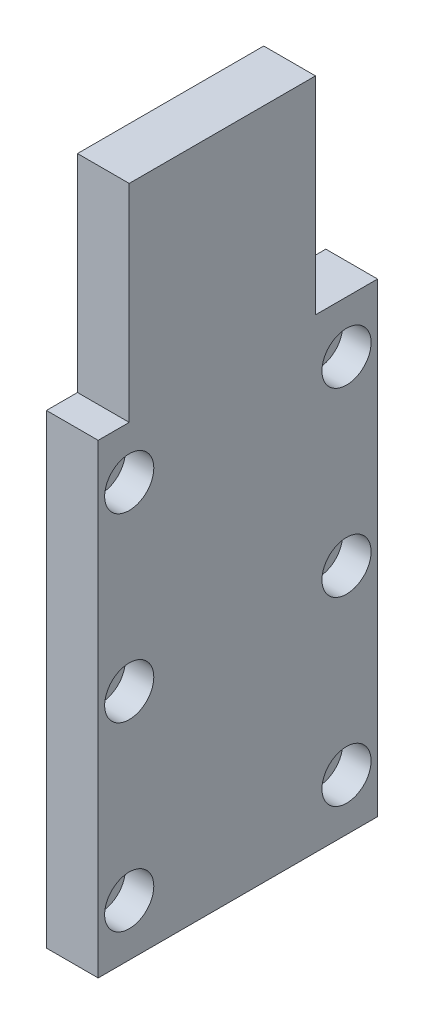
ISO-10303-21;
HEADER;
FILE_DESCRIPTION(('STEP AP214'),'2;1');
FILE_NAME('part.step','',(''),(''),'','','');
FILE_SCHEMA(('AUTOMOTIVE_DESIGN { 1 0 10303 214 1 1 1 1 }'));
ENDSEC;
DATA;
#1=APPLICATION_CONTEXT('core data for automotive mechanical design processes');
#2=APPLICATION_PROTOCOL_DEFINITION('international standard','automotive_design',2000,#1);
#3=PRODUCT_CONTEXT('',#1,'mechanical');
#4=PRODUCT('Part','Part','',(#3));
#5=PRODUCT_RELATED_PRODUCT_CATEGORY('part','',(#4));
#6=PRODUCT_DEFINITION_FORMATION('','',#4);
#7=PRODUCT_DEFINITION_CONTEXT('part definition',#1,'design');
#8=PRODUCT_DEFINITION('design','',#6,#7);
#9=PRODUCT_DEFINITION_SHAPE('','',#8);
#10=(LENGTH_UNIT() NAMED_UNIT(*) SI_UNIT(.MILLI.,.METRE.));
#11=(NAMED_UNIT(*) PLANE_ANGLE_UNIT() SI_UNIT($,.RADIAN.));
#12=(NAMED_UNIT(*) SI_UNIT($,.STERADIAN.) SOLID_ANGLE_UNIT());
#13=UNCERTAINTY_MEASURE_WITH_UNIT(LENGTH_MEASURE(1.E-05),#10,'distance_accuracy_value','');
#14=(GEOMETRIC_REPRESENTATION_CONTEXT(3) GLOBAL_UNCERTAINTY_ASSIGNED_CONTEXT((#13)) GLOBAL_UNIT_ASSIGNED_CONTEXT((#10,
#11,#12)) REPRESENTATION_CONTEXT('',''));
#15=CARTESIAN_POINT('',(0.,0.,0.));
#16=DIRECTION('',(0.,0.,1.));
#17=DIRECTION('',(1.,0.,0.));
#18=AXIS2_PLACEMENT_3D('',#15,#16,#17);
#19=CARTESIAN_POINT('',(-44.,9.99999999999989,48.));
#20=DIRECTION('',(1.,0.,0.));
#21=DIRECTION('',(0.,0.,-1.));
#22=AXIS2_PLACEMENT_3D('',#19,#20,#21);
#23=CYLINDRICAL_SURFACE('',#22,2.75);
#24=CARTESIAN_POINT('',(0.,9.99999999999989,48.));
#25=DIRECTION('',(1.,0.,0.));
#26=DIRECTION('',(0.,0.,-1.));
#27=AXIS2_PLACEMENT_3D('',#24,#25,#26);
#28=CIRCLE('',#27,2.75);
#29=CARTESIAN_POINT('',(0.,9.99999999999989,45.25));
#30=VERTEX_POINT('',#29);
#31=EDGE_CURVE('E161',#30,#30,#28,.T.);
#32=ORIENTED_EDGE('',*,*,#31,.F.);
#33=EDGE_LOOP('',(#32));
#34=FACE_BOUND('',#33,.T.);
#35=CARTESIAN_POINT('',(4.5,9.99999999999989,48.));
#36=DIRECTION('',(1.,0.,0.));
#37=DIRECTION('',(0.,0.,-1.));
#38=AXIS2_PLACEMENT_3D('',#35,#36,#37);
#39=CIRCLE('',#38,2.75);
#40=CARTESIAN_POINT('',(4.5,9.99999999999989,45.25));
#41=VERTEX_POINT('',#40);
#42=EDGE_CURVE('E37',#41,#41,#39,.F.);
#43=ORIENTED_EDGE('',*,*,#42,.F.);
#44=EDGE_LOOP('',(#43));
#45=FACE_BOUND('',#44,.T.);
#46=ADVANCED_FACE('F33',(#34,#45),#23,.F.);
#47=CARTESIAN_POINT('',(-44.,9.99999999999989,6.));
#48=DIRECTION('',(1.,0.,0.));
#49=DIRECTION('',(0.,0.,-1.));
#50=AXIS2_PLACEMENT_3D('',#47,#48,#49);
#51=CYLINDRICAL_SURFACE('',#50,2.75);
#52=CARTESIAN_POINT('',(0.,9.99999999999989,6.));
#53=DIRECTION('',(1.,0.,0.));
#54=DIRECTION('',(0.,0.,-1.));
#55=AXIS2_PLACEMENT_3D('',#52,#53,#54);
#56=CIRCLE('',#55,2.75);
#57=CARTESIAN_POINT('',(0.,9.99999999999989,3.25));
#58=VERTEX_POINT('',#57);
#59=EDGE_CURVE('E158',#58,#58,#56,.T.);
#60=ORIENTED_EDGE('',*,*,#59,.F.);
#61=EDGE_LOOP('',(#60));
#62=FACE_BOUND('',#61,.T.);
#63=CARTESIAN_POINT('',(4.5,9.99999999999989,6.));
#64=DIRECTION('',(1.,0.,0.));
#65=DIRECTION('',(0.,0.,-1.));
#66=AXIS2_PLACEMENT_3D('',#63,#64,#65);
#67=CIRCLE('',#66,2.75);
#68=CARTESIAN_POINT('',(4.5,9.99999999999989,3.25));
#69=VERTEX_POINT('',#68);
#70=EDGE_CURVE('E184',#69,#69,#67,.F.);
#71=ORIENTED_EDGE('',*,*,#70,.F.);
#72=EDGE_LOOP('',(#71));
#73=FACE_BOUND('',#72,.T.);
#74=ADVANCED_FACE('F259',(#62,#73),#51,.F.);
#75=CARTESIAN_POINT('',(-44.,44.9999999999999,6.));
#76=DIRECTION('',(1.,0.,0.));
#77=DIRECTION('',(0.,0.,-1.));
#78=AXIS2_PLACEMENT_3D('',#75,#76,#77);
#79=CYLINDRICAL_SURFACE('',#78,2.75);
#80=CARTESIAN_POINT('',(0.,44.9999999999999,6.));
#81=DIRECTION('',(1.,0.,0.));
#82=DIRECTION('',(0.,0.,-1.));
#83=AXIS2_PLACEMENT_3D('',#80,#81,#82);
#84=CIRCLE('',#83,2.75);
#85=CARTESIAN_POINT('',(0.,44.9999999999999,3.25));
#86=VERTEX_POINT('',#85);
#87=EDGE_CURVE('E155',#86,#86,#84,.T.);
#88=ORIENTED_EDGE('',*,*,#87,.F.);
#89=EDGE_LOOP('',(#88));
#90=FACE_BOUND('',#89,.T.);
#91=CARTESIAN_POINT('',(4.5,44.9999999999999,6.));
#92=DIRECTION('',(1.,0.,0.));
#93=DIRECTION('',(0.,0.,-1.));
#94=AXIS2_PLACEMENT_3D('',#91,#92,#93);
#95=CIRCLE('',#94,2.75);
#96=CARTESIAN_POINT('',(4.5,44.9999999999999,3.25));
#97=VERTEX_POINT('',#96);
#98=EDGE_CURVE('E180',#97,#97,#95,.F.);
#99=ORIENTED_EDGE('',*,*,#98,.F.);
#100=EDGE_LOOP('',(#99));
#101=FACE_BOUND('',#100,.T.);
#102=ADVANCED_FACE('F265',(#90,#101),#79,.F.);
#103=CARTESIAN_POINT('',(-44.,44.9999999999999,48.));
#104=DIRECTION('',(1.,0.,0.));
#105=DIRECTION('',(0.,0.,-1.));
#106=AXIS2_PLACEMENT_3D('',#103,#104,#105);
#107=CYLINDRICAL_SURFACE('',#106,2.75);
#108=CARTESIAN_POINT('',(0.,44.9999999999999,48.));
#109=DIRECTION('',(1.,0.,0.));
#110=DIRECTION('',(0.,0.,-1.));
#111=AXIS2_PLACEMENT_3D('',#108,#109,#110);
#112=CIRCLE('',#111,2.75);
#113=CARTESIAN_POINT('',(0.,44.9999999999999,45.25));
#114=VERTEX_POINT('',#113);
#115=EDGE_CURVE('E152',#114,#114,#112,.T.);
#116=ORIENTED_EDGE('',*,*,#115,.F.);
#117=EDGE_LOOP('',(#116));
#118=FACE_BOUND('',#117,.T.);
#119=CARTESIAN_POINT('',(4.5,44.9999999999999,48.));
#120=DIRECTION('',(1.,0.,0.));
#121=DIRECTION('',(0.,0.,-1.));
#122=AXIS2_PLACEMENT_3D('',#119,#120,#121);
#123=CIRCLE('',#122,2.75);
#124=CARTESIAN_POINT('',(4.5,44.9999999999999,45.25));
#125=VERTEX_POINT('',#124);
#126=EDGE_CURVE('E175',#125,#125,#123,.F.);
#127=ORIENTED_EDGE('',*,*,#126,.F.);
#128=EDGE_LOOP('',(#127));
#129=FACE_BOUND('',#128,.T.);
#130=ADVANCED_FACE('F276',(#118,#129),#107,.F.);
#131=CARTESIAN_POINT('',(-44.,79.9999999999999,6.));
#132=DIRECTION('',(1.,0.,0.));
#133=DIRECTION('',(0.,0.,-1.));
#134=AXIS2_PLACEMENT_3D('',#131,#132,#133);
#135=CYLINDRICAL_SURFACE('',#134,2.75);
#136=CARTESIAN_POINT('',(0.,79.9999999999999,6.));
#137=DIRECTION('',(1.,0.,0.));
#138=DIRECTION('',(0.,0.,-1.));
#139=AXIS2_PLACEMENT_3D('',#136,#137,#138);
#140=CIRCLE('',#139,2.75);
#141=CARTESIAN_POINT('',(0.,79.9999999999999,3.25));
#142=VERTEX_POINT('',#141);
#143=EDGE_CURVE('E149',#142,#142,#140,.T.);
#144=ORIENTED_EDGE('',*,*,#143,.F.);
#145=EDGE_LOOP('',(#144));
#146=FACE_BOUND('',#145,.T.);
#147=CARTESIAN_POINT('',(4.5,79.9999999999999,6.));
#148=DIRECTION('',(1.,0.,0.));
#149=DIRECTION('',(0.,0.,-1.));
#150=AXIS2_PLACEMENT_3D('',#147,#148,#149);
#151=CIRCLE('',#150,2.75);
#152=CARTESIAN_POINT('',(4.5,79.9999999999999,3.25));
#153=VERTEX_POINT('',#152);
#154=EDGE_CURVE('E170',#153,#153,#151,.F.);
#155=ORIENTED_EDGE('',*,*,#154,.F.);
#156=EDGE_LOOP('',(#155));
#157=FACE_BOUND('',#156,.T.);
#158=ADVANCED_FACE('F280',(#146,#157),#135,.F.);
#159=CARTESIAN_POINT('',(-44.,79.9999999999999,48.));
#160=DIRECTION('',(1.,0.,0.));
#161=DIRECTION('',(0.,0.,-1.));
#162=AXIS2_PLACEMENT_3D('',#159,#160,#161);
#163=CYLINDRICAL_SURFACE('',#162,2.75);
#164=CARTESIAN_POINT('',(0.,79.9999999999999,48.));
#165=DIRECTION('',(1.,0.,0.));
#166=DIRECTION('',(0.,0.,-1.));
#167=AXIS2_PLACEMENT_3D('',#164,#165,#166);
#168=CIRCLE('',#167,2.75);
#169=CARTESIAN_POINT('',(0.,79.9999999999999,45.25));
#170=VERTEX_POINT('',#169);
#171=EDGE_CURVE('E133',#170,#170,#168,.T.);
#172=ORIENTED_EDGE('',*,*,#171,.F.);
#173=EDGE_LOOP('',(#172));
#174=FACE_BOUND('',#173,.T.);
#175=CARTESIAN_POINT('',(4.5,79.9999999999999,48.));
#176=DIRECTION('',(1.,0.,0.));
#177=DIRECTION('',(0.,0.,-1.));
#178=AXIS2_PLACEMENT_3D('',#175,#176,#177);
#179=CIRCLE('',#178,2.75);
#180=CARTESIAN_POINT('',(4.5,79.9999999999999,45.25));
#181=VERTEX_POINT('',#180);
#182=EDGE_CURVE('E166',#181,#181,#179,.F.);
#183=ORIENTED_EDGE('',*,*,#182,.F.);
#184=EDGE_LOOP('',(#183));
#185=FACE_BOUND('',#184,.T.);
#186=ADVANCED_FACE('F284',(#174,#185),#163,.F.);
#187=CARTESIAN_POINT('',(10.,0.,54.));
#188=DIRECTION('',(-1.,0.,0.));
#189=DIRECTION('',(0.,0.,1.));
#190=AXIS2_PLACEMENT_3D('',#187,#188,#189);
#191=PLANE('',#190);
#192=CARTESIAN_POINT('',(10.,9.99999999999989,48.));
#193=DIRECTION('',(1.,0.,0.));
#194=DIRECTION('',(0.,0.,-1.));
#195=AXIS2_PLACEMENT_3D('',#192,#193,#194);
#196=CIRCLE('',#195,4.75);
#197=CARTESIAN_POINT('',(10.,9.99999999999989,43.25));
#198=VERTEX_POINT('',#197);
#199=EDGE_CURVE('E200',#198,#198,#196,.T.);
#200=ORIENTED_EDGE('',*,*,#199,.F.);
#201=EDGE_LOOP('',(#200));
#202=FACE_BOUND('',#201,.T.);
#203=CARTESIAN_POINT('',(10.,9.99999999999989,6.));
#204=DIRECTION('',(1.,0.,0.));
#205=DIRECTION('',(0.,0.,-1.));
#206=AXIS2_PLACEMENT_3D('',#203,#204,#205);
#207=CIRCLE('',#206,4.75);
#208=CARTESIAN_POINT('',(10.,9.99999999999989,1.25));
#209=VERTEX_POINT('',#208);
#210=EDGE_CURVE('E193',#209,#209,#207,.T.);
#211=ORIENTED_EDGE('',*,*,#210,.F.);
#212=EDGE_LOOP('',(#211));
#213=FACE_BOUND('',#212,.T.);
#214=CARTESIAN_POINT('',(10.,44.9999999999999,6.));
#215=DIRECTION('',(1.,0.,0.));
#216=DIRECTION('',(0.,0.,-1.));
#217=AXIS2_PLACEMENT_3D('',#214,#215,#216);
#218=CIRCLE('',#217,4.75);
#219=CARTESIAN_POINT('',(10.,44.9999999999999,1.25));
#220=VERTEX_POINT('',#219);
#221=EDGE_CURVE('E186',#220,#220,#218,.T.);
#222=ORIENTED_EDGE('',*,*,#221,.F.);
#223=EDGE_LOOP('',(#222));
#224=FACE_BOUND('',#223,.T.);
#225=CARTESIAN_POINT('',(10.,44.9999999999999,48.));
#226=DIRECTION('',(1.,0.,0.));
#227=DIRECTION('',(0.,0.,-1.));
#228=AXIS2_PLACEMENT_3D('',#225,#226,#227);
#229=CIRCLE('',#228,4.75);
#230=CARTESIAN_POINT('',(10.,44.9999999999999,43.25));
#231=VERTEX_POINT('',#230);
#232=EDGE_CURVE('E182',#231,#231,#229,.T.);
#233=ORIENTED_EDGE('',*,*,#232,.F.);
#234=EDGE_LOOP('',(#233));
#235=FACE_BOUND('',#234,.T.);
#236=CARTESIAN_POINT('',(10.,79.9999999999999,6.));
#237=DIRECTION('',(1.,0.,0.));
#238=DIRECTION('',(0.,0.,-1.));
#239=AXIS2_PLACEMENT_3D('',#236,#237,#238);
#240=CIRCLE('',#239,4.75);
#241=CARTESIAN_POINT('',(10.,79.9999999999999,1.25));
#242=VERTEX_POINT('',#241);
#243=EDGE_CURVE('E178',#242,#242,#240,.T.);
#244=ORIENTED_EDGE('',*,*,#243,.F.);
#245=EDGE_LOOP('',(#244));
#246=FACE_BOUND('',#245,.T.);
#247=CARTESIAN_POINT('',(10.,79.9999999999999,48.));
#248=DIRECTION('',(1.,0.,0.));
#249=DIRECTION('',(0.,0.,-1.));
#250=AXIS2_PLACEMENT_3D('',#247,#248,#249);
#251=CIRCLE('',#250,4.75);
#252=CARTESIAN_POINT('',(10.,79.9999999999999,43.25));
#253=VERTEX_POINT('',#252);
#254=EDGE_CURVE('E173',#253,#253,#251,.T.);
#255=ORIENTED_EDGE('',*,*,#254,.F.);
#256=EDGE_LOOP('',(#255));
#257=FACE_BOUND('',#256,.T.);
#258=DIRECTION('',(0.,1.,0.));
#259=VECTOR('',#258,1.);
#260=CARTESIAN_POINT('',(10.,89.9999999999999,12.));
#261=LINE('',#260,#259);
#262=CARTESIAN_POINT('',(10.,89.9999999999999,12.));
#263=VERTEX_POINT('',#262);
#264=CARTESIAN_POINT('',(10.,130.,12.));
#265=VERTEX_POINT('',#264);
#266=EDGE_CURVE('E219',#263,#265,#261,.T.);
#267=ORIENTED_EDGE('',*,*,#266,.T.);
#268=DIRECTION('',(0.,0.,-1.));
#269=VECTOR('',#268,1.);
#270=CARTESIAN_POINT('',(10.,130.,54.));
#271=LINE('',#270,#269);
#272=CARTESIAN_POINT('',(10.,130.,48.));
#273=VERTEX_POINT('',#272);
#274=EDGE_CURVE('E142',#273,#265,#271,.T.);
#275=ORIENTED_EDGE('',*,*,#274,.F.);
#276=DIRECTION('',(0.,-1.,0.));
#277=VECTOR('',#276,1.);
#278=CARTESIAN_POINT('',(10.,89.9999999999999,48.));
#279=LINE('',#278,#277);
#280=CARTESIAN_POINT('',(10.,89.9999999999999,48.));
#281=VERTEX_POINT('',#280);
#282=EDGE_CURVE('E115',#273,#281,#279,.T.);
#283=ORIENTED_EDGE('',*,*,#282,.T.);
#284=DIRECTION('',(0.,0.,1.));
#285=VECTOR('',#284,1.);
#286=CARTESIAN_POINT('',(10.,89.9999999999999,54.));
#287=LINE('',#286,#285);
#288=CARTESIAN_POINT('',(10.,89.9999999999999,54.));
#289=VERTEX_POINT('',#288);
#290=EDGE_CURVE('E101',#281,#289,#287,.T.);
#291=ORIENTED_EDGE('',*,*,#290,.T.);
#292=DIRECTION('',(0.,1.,0.));
#293=VECTOR('',#292,1.);
#294=CARTESIAN_POINT('',(10.,0.,54.));
#295=LINE('',#294,#293);
#296=CARTESIAN_POINT('',(10.,0.,54.));
#297=VERTEX_POINT('',#296);
#298=EDGE_CURVE('E112',#297,#289,#295,.T.);
#299=ORIENTED_EDGE('',*,*,#298,.F.);
#300=DIRECTION('',(0.,0.,-1.));
#301=VECTOR('',#300,1.);
#302=CARTESIAN_POINT('',(10.,0.,54.));
#303=LINE('',#302,#301);
#304=CARTESIAN_POINT('',(10.,0.,0.));
#305=VERTEX_POINT('',#304);
#306=EDGE_CURVE('E145',#297,#305,#303,.T.);
#307=ORIENTED_EDGE('',*,*,#306,.T.);
#308=DIRECTION('',(0.,1.,0.));
#309=VECTOR('',#308,1.);
#310=CARTESIAN_POINT('',(10.,0.,0.));
#311=LINE('',#310,#309);
#312=CARTESIAN_POINT('',(10.,89.9999999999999,0.));
#313=VERTEX_POINT('',#312);
#314=EDGE_CURVE('E132',#305,#313,#311,.T.);
#315=ORIENTED_EDGE('',*,*,#314,.T.);
#316=DIRECTION('',(0.,0.,1.));
#317=VECTOR('',#316,1.);
#318=CARTESIAN_POINT('',(10.,89.9999999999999,12.));
#319=LINE('',#318,#317);
#320=EDGE_CURVE('E58',#313,#263,#319,.T.);
#321=ORIENTED_EDGE('',*,*,#320,.T.);
#322=EDGE_LOOP('',(#267,#275,#283,#291,#299,#307,#315,#321));
#323=FACE_BOUND('',#322,.T.);
#324=ADVANCED_FACE('F110',(#202,#213,#224,#235,#246,#257,#323),#191,.F.);
#325=CARTESIAN_POINT('',(0.,130.,54.));
#326=DIRECTION('',(0.,-1.,0.));
#327=DIRECTION('',(0.,0.,-1.));
#328=AXIS2_PLACEMENT_3D('',#325,#326,#327);
#329=PLANE('',#328);
#330=DIRECTION('',(1.,0.,0.));
#331=VECTOR('',#330,1.);
#332=CARTESIAN_POINT('',(-44.,130.,48.));
#333=LINE('',#332,#331);
#334=CARTESIAN_POINT('',(0.,130.,48.));
#335=VERTEX_POINT('',#334);
#336=EDGE_CURVE('E222',#335,#273,#333,.T.);
#337=ORIENTED_EDGE('',*,*,#336,.T.);
#338=ORIENTED_EDGE('',*,*,#274,.T.);
#339=DIRECTION('',(1.,0.,0.));
#340=VECTOR('',#339,1.);
#341=CARTESIAN_POINT('',(-44.,130.,12.));
#342=LINE('',#341,#340);
#343=CARTESIAN_POINT('',(0.,130.,12.));
#344=VERTEX_POINT('',#343);
#345=EDGE_CURVE('E226',#344,#265,#342,.T.);
#346=ORIENTED_EDGE('',*,*,#345,.F.);
#347=DIRECTION('',(0.,0.,-1.));
#348=VECTOR('',#347,1.);
#349=CARTESIAN_POINT('',(0.,130.,54.));
#350=LINE('',#349,#348);
#351=EDGE_CURVE('E139',#335,#344,#350,.T.);
#352=ORIENTED_EDGE('',*,*,#351,.F.);
#353=EDGE_LOOP('',(#337,#338,#346,#352));
#354=FACE_BOUND('',#353,.T.);
#355=ADVANCED_FACE('F245',(#354),#329,.F.);
#356=CARTESIAN_POINT('',(0.,0.,54.));
#357=DIRECTION('',(1.,0.,0.));
#358=DIRECTION('',(0.,0.,-1.));
#359=AXIS2_PLACEMENT_3D('',#356,#357,#358);
#360=PLANE('',#359);
#361=ORIENTED_EDGE('',*,*,#31,.T.);
#362=EDGE_LOOP('',(#361));
#363=FACE_BOUND('',#362,.T.);
#364=ORIENTED_EDGE('',*,*,#59,.T.);
#365=EDGE_LOOP('',(#364));
#366=FACE_BOUND('',#365,.T.);
#367=ORIENTED_EDGE('',*,*,#87,.T.);
#368=EDGE_LOOP('',(#367));
#369=FACE_BOUND('',#368,.T.);
#370=ORIENTED_EDGE('',*,*,#115,.T.);
#371=EDGE_LOOP('',(#370));
#372=FACE_BOUND('',#371,.T.);
#373=ORIENTED_EDGE('',*,*,#143,.T.);
#374=EDGE_LOOP('',(#373));
#375=FACE_BOUND('',#374,.T.);
#376=ORIENTED_EDGE('',*,*,#171,.T.);
#377=EDGE_LOOP('',(#376));
#378=FACE_BOUND('',#377,.T.);
#379=DIRECTION('',(0.,1.,0.));
#380=VECTOR('',#379,1.);
#381=CARTESIAN_POINT('',(0.,0.,12.));
#382=LINE('',#381,#380);
#383=CARTESIAN_POINT('',(0.,89.9999999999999,12.));
#384=VERTEX_POINT('',#383);
#385=EDGE_CURVE('E12',#384,#344,#382,.T.);
#386=ORIENTED_EDGE('',*,*,#385,.F.);
#387=DIRECTION('',(0.,0.,1.));
#388=VECTOR('',#387,1.);
#389=CARTESIAN_POINT('',(0.,89.9999999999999,54.));
#390=LINE('',#389,#388);
#391=CARTESIAN_POINT('',(0.,89.9999999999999,0.));
#392=VERTEX_POINT('',#391);
#393=EDGE_CURVE('E225',#392,#384,#390,.T.);
#394=ORIENTED_EDGE('',*,*,#393,.F.);
#395=DIRECTION('',(0.,-1.,0.));
#396=VECTOR('',#395,1.);
#397=CARTESIAN_POINT('',(0.,0.,0.));
#398=LINE('',#397,#396);
#399=CARTESIAN_POINT('',(0.,0.,0.));
#400=VERTEX_POINT('',#399);
#401=EDGE_CURVE('E125',#392,#400,#398,.T.);
#402=ORIENTED_EDGE('',*,*,#401,.T.);
#403=DIRECTION('',(0.,0.,-1.));
#404=VECTOR('',#403,1.);
#405=CARTESIAN_POINT('',(0.,0.,54.));
#406=LINE('',#405,#404);
#407=CARTESIAN_POINT('',(0.,0.,54.));
#408=VERTEX_POINT('',#407);
#409=EDGE_CURVE('E123',#408,#400,#406,.T.);
#410=ORIENTED_EDGE('',*,*,#409,.F.);
#411=DIRECTION('',(0.,-1.,0.));
#412=VECTOR('',#411,1.);
#413=CARTESIAN_POINT('',(0.,0.,54.));
#414=LINE('',#413,#412);
#415=CARTESIAN_POINT('',(0.,89.9999999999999,54.));
#416=VERTEX_POINT('',#415);
#417=EDGE_CURVE('E121',#416,#408,#414,.T.);
#418=ORIENTED_EDGE('',*,*,#417,.F.);
#419=DIRECTION('',(0.,0.,1.));
#420=VECTOR('',#419,1.);
#421=CARTESIAN_POINT('',(0.,89.9999999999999,54.));
#422=LINE('',#421,#420);
#423=CARTESIAN_POINT('',(0.,89.9999999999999,48.));
#424=VERTEX_POINT('',#423);
#425=EDGE_CURVE('E50',#424,#416,#422,.T.);
#426=ORIENTED_EDGE('',*,*,#425,.F.);
#427=DIRECTION('',(0.,-1.,0.));
#428=VECTOR('',#427,1.);
#429=CARTESIAN_POINT('',(0.,0.,48.));
#430=LINE('',#429,#428);
#431=EDGE_CURVE('E42',#335,#424,#430,.T.);
#432=ORIENTED_EDGE('',*,*,#431,.F.);
#433=ORIENTED_EDGE('',*,*,#351,.T.);
#434=EDGE_LOOP('',(#386,#394,#402,#410,#418,#426,#432,#433));
#435=FACE_BOUND('',#434,.T.);
#436=ADVANCED_FACE('F241',(#363,#366,#369,#372,#375,#378,#435),#360,.F.);
#437=CARTESIAN_POINT('',(10.,0.,54.));
#438=DIRECTION('',(0.,0.,1.));
#439=DIRECTION('',(1.,0.,0.));
#440=AXIS2_PLACEMENT_3D('',#437,#438,#439);
#441=PLANE('',#440);
#442=ORIENTED_EDGE('',*,*,#298,.T.);
#443=DIRECTION('',(-1.,0.,0.));
#444=VECTOR('',#443,1.);
#445=CARTESIAN_POINT('',(10.,89.9999999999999,54.));
#446=LINE('',#445,#444);
#447=EDGE_CURVE('E98',#289,#416,#446,.T.);
#448=ORIENTED_EDGE('',*,*,#447,.T.);
#449=ORIENTED_EDGE('',*,*,#417,.T.);
#450=DIRECTION('',(1.,0.,0.));
#451=VECTOR('',#450,1.);
#452=CARTESIAN_POINT('',(0.,0.,54.));
#453=LINE('',#452,#451);
#454=EDGE_CURVE('E119',#408,#297,#453,.T.);
#455=ORIENTED_EDGE('',*,*,#454,.T.);
#456=EDGE_LOOP('',(#442,#448,#449,#455));
#457=FACE_BOUND('',#456,.T.);
#458=ADVANCED_FACE('F117',(#457),#441,.T.);
#459=CARTESIAN_POINT('',(10.,0.,0.));
#460=DIRECTION('',(0.,0.,1.));
#461=DIRECTION('',(1.,0.,0.));
#462=AXIS2_PLACEMENT_3D('',#459,#460,#461);
#463=PLANE('',#462);
#464=DIRECTION('',(-1.,0.,0.));
#465=VECTOR('',#464,1.);
#466=CARTESIAN_POINT('',(10.,89.9999999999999,0.));
#467=LINE('',#466,#465);
#468=EDGE_CURVE('E106',#313,#392,#467,.T.);
#469=ORIENTED_EDGE('',*,*,#468,.F.);
#470=ORIENTED_EDGE('',*,*,#314,.F.);
#471=DIRECTION('',(1.,0.,0.));
#472=VECTOR('',#471,1.);
#473=CARTESIAN_POINT('',(0.,0.,0.));
#474=LINE('',#473,#472);
#475=EDGE_CURVE('E129',#400,#305,#474,.T.);
#476=ORIENTED_EDGE('',*,*,#475,.F.);
#477=ORIENTED_EDGE('',*,*,#401,.F.);
#478=EDGE_LOOP('',(#469,#470,#476,#477));
#479=FACE_BOUND('',#478,.T.);
#480=ADVANCED_FACE('F248',(#479),#463,.F.);
#481=CARTESIAN_POINT('',(0.,0.,54.));
#482=DIRECTION('',(0.,1.,0.));
#483=DIRECTION('',(0.,0.,1.));
#484=AXIS2_PLACEMENT_3D('',#481,#482,#483);
#485=PLANE('',#484);
#486=ORIENTED_EDGE('',*,*,#475,.T.);
#487=ORIENTED_EDGE('',*,*,#306,.F.);
#488=ORIENTED_EDGE('',*,*,#454,.F.);
#489=ORIENTED_EDGE('',*,*,#409,.T.);
#490=EDGE_LOOP('',(#486,#487,#488,#489));
#491=FACE_BOUND('',#490,.T.);
#492=ADVANCED_FACE('F35',(#491),#485,.F.);
#493=CARTESIAN_POINT('',(-44.,89.9999999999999,12.));
#494=DIRECTION('',(0.,1.,0.));
#495=DIRECTION('',(0.,0.,1.));
#496=AXIS2_PLACEMENT_3D('',#493,#494,#495);
#497=PLANE('',#496);
#498=ORIENTED_EDGE('',*,*,#393,.T.);
#499=DIRECTION('',(1.,0.,0.));
#500=VECTOR('',#499,1.);
#501=CARTESIAN_POINT('',(-44.,89.9999999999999,12.));
#502=LINE('',#501,#500);
#503=EDGE_CURVE('E228',#384,#263,#502,.T.);
#504=ORIENTED_EDGE('',*,*,#503,.T.);
#505=ORIENTED_EDGE('',*,*,#320,.F.);
#506=ORIENTED_EDGE('',*,*,#468,.T.);
#507=EDGE_LOOP('',(#498,#504,#505,#506));
#508=FACE_BOUND('',#507,.T.);
#509=ADVANCED_FACE('F233',(#508),#497,.T.);
#510=CARTESIAN_POINT('',(-44.,89.9999999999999,12.));
#511=DIRECTION('',(0.,0.,-1.));
#512=DIRECTION('',(-1.,0.,0.));
#513=AXIS2_PLACEMENT_3D('',#510,#511,#512);
#514=PLANE('',#513);
#515=ORIENTED_EDGE('',*,*,#385,.T.);
#516=ORIENTED_EDGE('',*,*,#345,.T.);
#517=ORIENTED_EDGE('',*,*,#266,.F.);
#518=ORIENTED_EDGE('',*,*,#503,.F.);
#519=EDGE_LOOP('',(#515,#516,#517,#518));
#520=FACE_BOUND('',#519,.T.);
#521=ADVANCED_FACE('F239',(#520),#514,.T.);
#522=CARTESIAN_POINT('',(-44.,89.9999999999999,48.));
#523=DIRECTION('',(0.,0.,1.));
#524=DIRECTION('',(1.,0.,0.));
#525=AXIS2_PLACEMENT_3D('',#522,#523,#524);
#526=PLANE('',#525);
#527=ORIENTED_EDGE('',*,*,#431,.T.);
#528=DIRECTION('',(1.,0.,0.));
#529=VECTOR('',#528,1.);
#530=CARTESIAN_POINT('',(-44.,89.9999999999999,48.));
#531=LINE('',#530,#529);
#532=EDGE_CURVE('E221',#424,#281,#531,.T.);
#533=ORIENTED_EDGE('',*,*,#532,.T.);
#534=ORIENTED_EDGE('',*,*,#282,.F.);
#535=ORIENTED_EDGE('',*,*,#336,.F.);
#536=EDGE_LOOP('',(#527,#533,#534,#535));
#537=FACE_BOUND('',#536,.T.);
#538=ADVANCED_FACE('F271',(#537),#526,.T.);
#539=CARTESIAN_POINT('',(-44.,89.9999999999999,54.));
#540=DIRECTION('',(0.,1.,0.));
#541=DIRECTION('',(0.,0.,1.));
#542=AXIS2_PLACEMENT_3D('',#539,#540,#541);
#543=PLANE('',#542);
#544=ORIENTED_EDGE('',*,*,#425,.T.);
#545=ORIENTED_EDGE('',*,*,#447,.F.);
#546=ORIENTED_EDGE('',*,*,#290,.F.);
#547=ORIENTED_EDGE('',*,*,#532,.F.);
#548=EDGE_LOOP('',(#544,#545,#546,#547));
#549=FACE_BOUND('',#548,.T.);
#550=ADVANCED_FACE('F100',(#549),#543,.T.);
#551=CARTESIAN_POINT('',(4.5,79.9999999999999,48.));
#552=DIRECTION('',(1.,0.,0.));
#553=DIRECTION('',(0.,0.,-1.));
#554=AXIS2_PLACEMENT_3D('',#551,#552,#553);
#555=PLANE('',#554);
#556=CARTESIAN_POINT('',(4.5,79.9999999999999,48.));
#557=DIRECTION('',(1.,0.,0.));
#558=DIRECTION('',(0.,0.,-1.));
#559=AXIS2_PLACEMENT_3D('',#556,#557,#558);
#560=CIRCLE('',#559,4.75);
#561=CARTESIAN_POINT('',(4.5,79.9999999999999,43.25));
#562=VERTEX_POINT('',#561);
#563=EDGE_CURVE('E169',#562,#562,#560,.T.);
#564=ORIENTED_EDGE('',*,*,#563,.T.);
#565=EDGE_LOOP('',(#564));
#566=FACE_BOUND('',#565,.T.);
#567=ORIENTED_EDGE('',*,*,#182,.T.);
#568=EDGE_LOOP('',(#567));
#569=FACE_BOUND('',#568,.T.);
#570=ADVANCED_FACE('F315',(#566,#569),#555,.T.);
#571=CARTESIAN_POINT('',(4.5,79.9999999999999,48.));
#572=DIRECTION('',(1.,0.,0.));
#573=DIRECTION('',(0.,0.,-1.));
#574=AXIS2_PLACEMENT_3D('',#571,#572,#573);
#575=CYLINDRICAL_SURFACE('',#574,4.75);
#576=ORIENTED_EDGE('',*,*,#563,.F.);
#577=EDGE_LOOP('',(#576));
#578=FACE_BOUND('',#577,.T.);
#579=ORIENTED_EDGE('',*,*,#254,.T.);
#580=EDGE_LOOP('',(#579));
#581=FACE_BOUND('',#580,.T.);
#582=ADVANCED_FACE('F312',(#578,#581),#575,.F.);
#583=CARTESIAN_POINT('',(4.5,79.9999999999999,6.));
#584=DIRECTION('',(1.,0.,0.));
#585=DIRECTION('',(0.,0.,-1.));
#586=AXIS2_PLACEMENT_3D('',#583,#584,#585);
#587=PLANE('',#586);
#588=CARTESIAN_POINT('',(4.5,79.9999999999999,6.));
#589=DIRECTION('',(1.,0.,0.));
#590=DIRECTION('',(0.,0.,-1.));
#591=AXIS2_PLACEMENT_3D('',#588,#589,#590);
#592=CIRCLE('',#591,4.75);
#593=CARTESIAN_POINT('',(4.5,79.9999999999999,1.25));
#594=VERTEX_POINT('',#593);
#595=EDGE_CURVE('E174',#594,#594,#592,.T.);
#596=ORIENTED_EDGE('',*,*,#595,.T.);
#597=EDGE_LOOP('',(#596));
#598=FACE_BOUND('',#597,.T.);
#599=ORIENTED_EDGE('',*,*,#154,.T.);
#600=EDGE_LOOP('',(#599));
#601=FACE_BOUND('',#600,.T.);
#602=ADVANCED_FACE('F314',(#598,#601),#587,.T.);
#603=CARTESIAN_POINT('',(4.5,79.9999999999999,6.));
#604=DIRECTION('',(1.,0.,0.));
#605=DIRECTION('',(0.,0.,-1.));
#606=AXIS2_PLACEMENT_3D('',#603,#604,#605);
#607=CYLINDRICAL_SURFACE('',#606,4.75);
#608=ORIENTED_EDGE('',*,*,#595,.F.);
#609=EDGE_LOOP('',(#608));
#610=FACE_BOUND('',#609,.T.);
#611=ORIENTED_EDGE('',*,*,#243,.T.);
#612=EDGE_LOOP('',(#611));
#613=FACE_BOUND('',#612,.T.);
#614=ADVANCED_FACE('F322',(#610,#613),#607,.F.);
#615=CARTESIAN_POINT('',(4.5,44.9999999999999,48.));
#616=DIRECTION('',(1.,0.,0.));
#617=DIRECTION('',(0.,0.,-1.));
#618=AXIS2_PLACEMENT_3D('',#615,#616,#617);
#619=PLANE('',#618);
#620=CARTESIAN_POINT('',(4.5,44.9999999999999,48.));
#621=DIRECTION('',(1.,0.,0.));
#622=DIRECTION('',(0.,0.,-1.));
#623=AXIS2_PLACEMENT_3D('',#620,#621,#622);
#624=CIRCLE('',#623,4.75);
#625=CARTESIAN_POINT('',(4.5,44.9999999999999,43.25));
#626=VERTEX_POINT('',#625);
#627=EDGE_CURVE('E179',#626,#626,#624,.T.);
#628=ORIENTED_EDGE('',*,*,#627,.T.);
#629=EDGE_LOOP('',(#628));
#630=FACE_BOUND('',#629,.T.);
#631=ORIENTED_EDGE('',*,*,#126,.T.);
#632=EDGE_LOOP('',(#631));
#633=FACE_BOUND('',#632,.T.);
#634=ADVANCED_FACE('F408',(#630,#633),#619,.T.);
#635=CARTESIAN_POINT('',(4.5,44.9999999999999,48.));
#636=DIRECTION('',(1.,0.,0.));
#637=DIRECTION('',(0.,0.,-1.));
#638=AXIS2_PLACEMENT_3D('',#635,#636,#637);
#639=CYLINDRICAL_SURFACE('',#638,4.75);
#640=ORIENTED_EDGE('',*,*,#627,.F.);
#641=EDGE_LOOP('',(#640));
#642=FACE_BOUND('',#641,.T.);
#643=ORIENTED_EDGE('',*,*,#232,.T.);
#644=EDGE_LOOP('',(#643));
#645=FACE_BOUND('',#644,.T.);
#646=ADVANCED_FACE('F417',(#642,#645),#639,.F.);
#647=CARTESIAN_POINT('',(4.5,44.9999999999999,6.));
#648=DIRECTION('',(1.,0.,0.));
#649=DIRECTION('',(0.,0.,-1.));
#650=AXIS2_PLACEMENT_3D('',#647,#648,#649);
#651=PLANE('',#650);
#652=CARTESIAN_POINT('',(4.5,44.9999999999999,6.));
#653=DIRECTION('',(1.,0.,0.));
#654=DIRECTION('',(0.,0.,-1.));
#655=AXIS2_PLACEMENT_3D('',#652,#653,#654);
#656=CIRCLE('',#655,4.75);
#657=CARTESIAN_POINT('',(4.5,44.9999999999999,1.25));
#658=VERTEX_POINT('',#657);
#659=EDGE_CURVE('E183',#658,#658,#656,.T.);
#660=ORIENTED_EDGE('',*,*,#659,.T.);
#661=EDGE_LOOP('',(#660));
#662=FACE_BOUND('',#661,.T.);
#663=ORIENTED_EDGE('',*,*,#98,.T.);
#664=EDGE_LOOP('',(#663));
#665=FACE_BOUND('',#664,.T.);
#666=ADVANCED_FACE('F427',(#662,#665),#651,.T.);
#667=CARTESIAN_POINT('',(4.5,44.9999999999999,6.));
#668=DIRECTION('',(1.,0.,0.));
#669=DIRECTION('',(0.,0.,-1.));
#670=AXIS2_PLACEMENT_3D('',#667,#668,#669);
#671=CYLINDRICAL_SURFACE('',#670,4.75);
#672=ORIENTED_EDGE('',*,*,#659,.F.);
#673=EDGE_LOOP('',(#672));
#674=FACE_BOUND('',#673,.T.);
#675=ORIENTED_EDGE('',*,*,#221,.T.);
#676=EDGE_LOOP('',(#675));
#677=FACE_BOUND('',#676,.T.);
#678=ADVANCED_FACE('F437',(#674,#677),#671,.F.);
#679=CARTESIAN_POINT('',(4.5,9.99999999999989,6.));
#680=DIRECTION('',(1.,0.,0.));
#681=DIRECTION('',(0.,0.,-1.));
#682=AXIS2_PLACEMENT_3D('',#679,#680,#681);
#683=PLANE('',#682);
#684=CARTESIAN_POINT('',(4.5,9.99999999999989,6.));
#685=DIRECTION('',(1.,0.,0.));
#686=DIRECTION('',(0.,0.,-1.));
#687=AXIS2_PLACEMENT_3D('',#684,#685,#686);
#688=CIRCLE('',#687,4.75);
#689=CARTESIAN_POINT('',(4.5,9.99999999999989,1.25));
#690=VERTEX_POINT('',#689);
#691=EDGE_CURVE('E187',#690,#690,#688,.T.);
#692=ORIENTED_EDGE('',*,*,#691,.T.);
#693=EDGE_LOOP('',(#692));
#694=FACE_BOUND('',#693,.T.);
#695=ORIENTED_EDGE('',*,*,#70,.T.);
#696=EDGE_LOOP('',(#695));
#697=FACE_BOUND('',#696,.T.);
#698=ADVANCED_FACE('F447',(#694,#697),#683,.T.);
#699=CARTESIAN_POINT('',(4.5,9.99999999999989,6.));
#700=DIRECTION('',(1.,0.,0.));
#701=DIRECTION('',(0.,0.,-1.));
#702=AXIS2_PLACEMENT_3D('',#699,#700,#701);
#703=CYLINDRICAL_SURFACE('',#702,4.75);
#704=ORIENTED_EDGE('',*,*,#691,.F.);
#705=EDGE_LOOP('',(#704));
#706=FACE_BOUND('',#705,.T.);
#707=ORIENTED_EDGE('',*,*,#210,.T.);
#708=EDGE_LOOP('',(#707));
#709=FACE_BOUND('',#708,.T.);
#710=ADVANCED_FACE('F457',(#706,#709),#703,.F.);
#711=CARTESIAN_POINT('',(4.5,9.99999999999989,48.));
#712=DIRECTION('',(1.,0.,0.));
#713=DIRECTION('',(0.,0.,-1.));
#714=AXIS2_PLACEMENT_3D('',#711,#712,#713);
#715=PLANE('',#714);
#716=CARTESIAN_POINT('',(4.5,9.99999999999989,48.));
#717=DIRECTION('',(1.,0.,0.));
#718=DIRECTION('',(0.,0.,-1.));
#719=AXIS2_PLACEMENT_3D('',#716,#717,#718);
#720=CIRCLE('',#719,4.75);
#721=CARTESIAN_POINT('',(4.5,9.99999999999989,43.25));
#722=VERTEX_POINT('',#721);
#723=EDGE_CURVE('E493',#722,#722,#720,.T.);
#724=ORIENTED_EDGE('',*,*,#723,.T.);
#725=EDGE_LOOP('',(#724));
#726=FACE_BOUND('',#725,.T.);
#727=ORIENTED_EDGE('',*,*,#42,.T.);
#728=EDGE_LOOP('',(#727));
#729=FACE_BOUND('',#728,.T.);
#730=ADVANCED_FACE('F466',(#726,#729),#715,.T.);
#731=CARTESIAN_POINT('',(4.5,9.99999999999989,48.));
#732=DIRECTION('',(1.,0.,0.));
#733=DIRECTION('',(0.,0.,-1.));
#734=AXIS2_PLACEMENT_3D('',#731,#732,#733);
#735=CYLINDRICAL_SURFACE('',#734,4.75);
#736=ORIENTED_EDGE('',*,*,#723,.F.);
#737=EDGE_LOOP('',(#736));
#738=FACE_BOUND('',#737,.T.);
#739=ORIENTED_EDGE('',*,*,#199,.T.);
#740=EDGE_LOOP('',(#739));
#741=FACE_BOUND('',#740,.T.);
#742=ADVANCED_FACE('F476',(#738,#741),#735,.F.);
#743=CLOSED_SHELL('',(#46,#74,#102,#130,#158,#186,#324,#355,#436,#458,#480,#492,#509,#521,#538,
#550,#570,#582,#602,#614,#634,#646,#666,#678,#698,#710,#730,#742));
#744=MANIFOLD_SOLID_BREP('B2',#743);
#745=ADVANCED_BREP_SHAPE_REPRESENTATION('',(#18,#744),#14);
#746=SHAPE_DEFINITION_REPRESENTATION(#9,#745);
ENDSEC;
END-ISO-10303-21;
